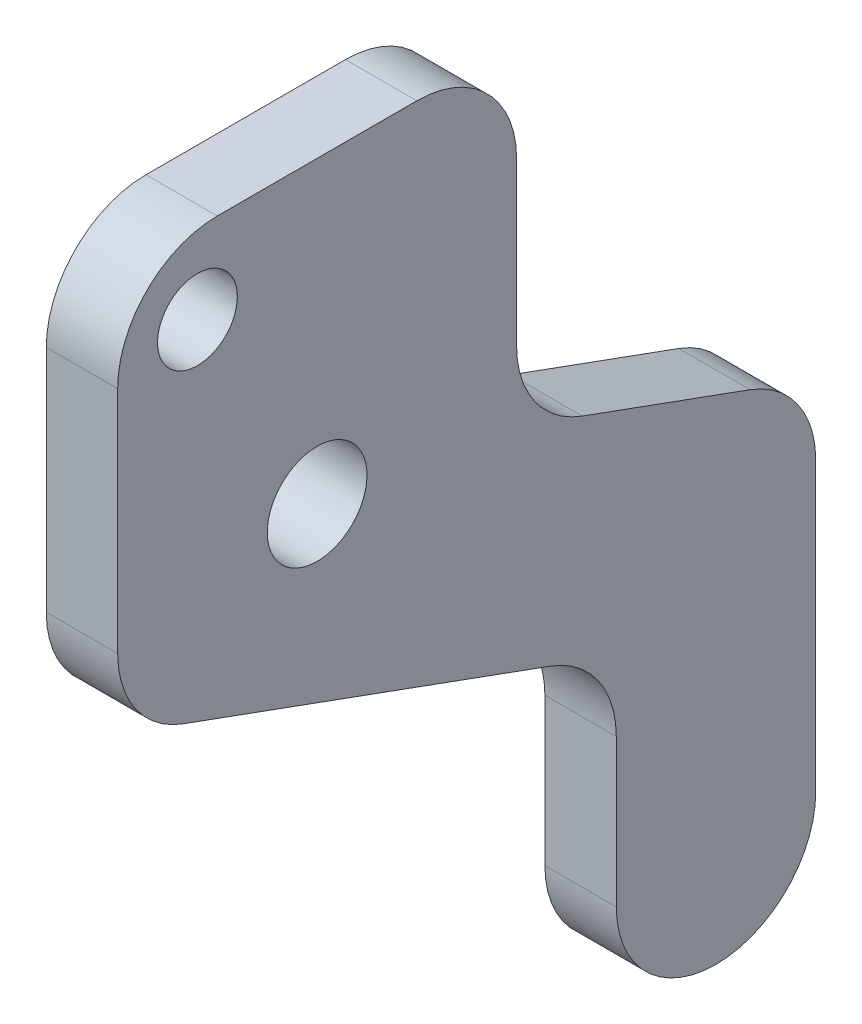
ISO-10303-21;
HEADER;
FILE_DESCRIPTION(('STEP AP214'),'2;1');
FILE_NAME('part.step','',(''),(''),'','','');
FILE_SCHEMA(('AUTOMOTIVE_DESIGN { 1 0 10303 214 1 1 1 1 }'));
ENDSEC;
DATA;
#1=APPLICATION_CONTEXT('core data for automotive mechanical design processes');
#2=APPLICATION_PROTOCOL_DEFINITION('international standard','automotive_design',2000,#1);
#3=PRODUCT_CONTEXT('',#1,'mechanical');
#4=PRODUCT('Part','Part','',(#3));
#5=PRODUCT_RELATED_PRODUCT_CATEGORY('part','',(#4));
#6=PRODUCT_DEFINITION_FORMATION('','',#4);
#7=PRODUCT_DEFINITION_CONTEXT('part definition',#1,'design');
#8=PRODUCT_DEFINITION('design','',#6,#7);
#9=PRODUCT_DEFINITION_SHAPE('','',#8);
#10=(LENGTH_UNIT() NAMED_UNIT(*) SI_UNIT(.MILLI.,.METRE.));
#11=(NAMED_UNIT(*) PLANE_ANGLE_UNIT() SI_UNIT($,.RADIAN.));
#12=(NAMED_UNIT(*) SI_UNIT($,.STERADIAN.) SOLID_ANGLE_UNIT());
#13=UNCERTAINTY_MEASURE_WITH_UNIT(LENGTH_MEASURE(1.E-05),#10,'distance_accuracy_value','');
#14=(GEOMETRIC_REPRESENTATION_CONTEXT(3) GLOBAL_UNCERTAINTY_ASSIGNED_CONTEXT((#13)) GLOBAL_UNIT_ASSIGNED_CONTEXT((#10,
#11,#12)) REPRESENTATION_CONTEXT('',''));
#15=CARTESIAN_POINT('',(0.,0.,0.));
#16=DIRECTION('',(0.,0.,1.));
#17=DIRECTION('',(1.,0.,0.));
#18=AXIS2_PLACEMENT_3D('',#15,#16,#17);
#19=CARTESIAN_POINT('',(230.378,0.,0.));
#20=DIRECTION('',(1.,0.,0.));
#21=DIRECTION('',(0.,0.,-1.));
#22=AXIS2_PLACEMENT_3D('',#19,#20,#21);
#23=PLANE('',#22);
#24=CARTESIAN_POINT('',(230.378,60.212881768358,-1160.75843540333));
#25=DIRECTION('',(1.,0.,0.));
#26=DIRECTION('',(0.,0.,-1.));
#27=AXIS2_PLACEMENT_3D('',#24,#25,#26);
#28=CIRCLE('',#27,2.54000000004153);
#29=CARTESIAN_POINT('',(230.378,60.212881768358,-1163.29843540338));
#30=VERTEX_POINT('',#29);
#31=EDGE_CURVE('E325',#30,#30,#28,.T.);
#32=ORIENTED_EDGE('',*,*,#31,.F.);
#33=EDGE_LOOP('',(#32));
#34=FACE_BOUND('',#33,.T.);
#35=DIRECTION('',(0.,1.,0.));
#36=VECTOR('',#35,1.);
#37=CARTESIAN_POINT('',(230.378,44.1630955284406,-1181.07843540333));
#38=LINE('',#37,#36);
#39=CARTESIAN_POINT('',(230.378,48.6094133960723,-1181.07843540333));
#40=VERTEX_POINT('',#39);
#41=CARTESIAN_POINT('',(230.378,58.942881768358,-1181.07843540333));
#42=VERTEX_POINT('',#41);
#43=EDGE_CURVE('E168',#40,#42,#38,.T.);
#44=ORIENTED_EDGE('',*,*,#43,.T.);
#45=CARTESIAN_POINT('',(230.378,58.942881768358,-1174.72843540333));
#46=DIRECTION('',(1.,0.,0.));
#47=DIRECTION('',(0.,0.,-1.));
#48=AXIS2_PLACEMENT_3D('',#45,#46,#47);
#49=CIRCLE('',#48,6.35);
#50=CARTESIAN_POINT('',(230.378,65.292881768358,-1174.72843540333));
#51=VERTEX_POINT('',#50);
#52=EDGE_CURVE('E225',#42,#51,#49,.T.);
#53=ORIENTED_EDGE('',*,*,#52,.T.);
#54=DIRECTION('',(0.,0.,1.));
#55=VECTOR('',#54,1.);
#56=CARTESIAN_POINT('',(230.378,65.292881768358,-1155.67843540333));
#57=LINE('',#56,#55);
#58=CARTESIAN_POINT('',(230.378,65.292881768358,-1162.02843540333));
#59=VERTEX_POINT('',#58);
#60=EDGE_CURVE('E176',#51,#59,#57,.T.);
#61=ORIENTED_EDGE('',*,*,#60,.T.);
#62=CARTESIAN_POINT('',(230.378,58.942881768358,-1162.02843540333));
#63=DIRECTION('',(1.,0.,0.));
#64=DIRECTION('',(0.,0.,-1.));
#65=AXIS2_PLACEMENT_3D('',#62,#63,#64);
#66=CIRCLE('',#65,6.35);
#67=CARTESIAN_POINT('',(230.378,58.942881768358,-1155.67843540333));
#68=VERTEX_POINT('',#67);
#69=EDGE_CURVE('E216',#59,#68,#66,.T.);
#70=ORIENTED_EDGE('',*,*,#69,.T.);
#71=DIRECTION('',(0.,-1.,0.));
#72=VECTOR('',#71,1.);
#73=CARTESIAN_POINT('',(230.378,65.292881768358,-1155.67843540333));
#74=LINE('',#73,#72);
#75=CARTESIAN_POINT('',(230.378,44.3391996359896,-1155.67843540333));
#76=VERTEX_POINT('',#75);
#77=EDGE_CURVE('E180',#68,#76,#74,.T.);
#78=ORIENTED_EDGE('',*,*,#77,.T.);
#79=CARTESIAN_POINT('',(230.378,44.3391996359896,-1162.02843540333));
#80=DIRECTION('',(1.,0.,0.));
#81=DIRECTION('',(0.,0.,-1.));
#82=AXIS2_PLACEMENT_3D('',#79,#80,#81);
#83=CIRCLE('',#82,6.35);
#84=CARTESIAN_POINT('',(230.378,38.3721514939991,-1159.85660749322));
#85=VERTEX_POINT('',#84);
#86=EDGE_CURVE('E218',#76,#85,#83,.T.);
#87=ORIENTED_EDGE('',*,*,#86,.T.);
#88=DIRECTION('',(0.,-0.342020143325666,-0.93969262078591));
#89=VECTOR('',#88,1.);
#90=CARTESIAN_POINT('',(230.378,39.892881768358,-1155.67843540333));
#91=LINE('',#90,#89);
#92=CARTESIAN_POINT('',(230.378,29.8575571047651,-1183.25026331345));
#93=VERTEX_POINT('',#92);
#94=EDGE_CURVE('E259',#85,#93,#91,.T.);
#95=ORIENTED_EDGE('',*,*,#94,.T.);
#96=CARTESIAN_POINT('',(230.378,23.8905089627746,-1181.07843540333));
#97=DIRECTION('',(1.,0.,0.));
#98=DIRECTION('',(0.,0.,-1.));
#99=AXIS2_PLACEMENT_3D('',#96,#97,#98);
#100=CIRCLE('',#99,6.35);
#101=CARTESIAN_POINT('',(230.378,23.8905089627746,-1187.42843540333));
#102=VERTEX_POINT('',#101);
#103=EDGE_CURVE('E11',#93,#102,#100,.F.);
#104=ORIENTED_EDGE('',*,*,#103,.T.);
#105=DIRECTION('',(0.,-1.,0.));
#106=VECTOR('',#105,1.);
#107=CARTESIAN_POINT('',(230.378,28.3368268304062,-1187.42843540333));
#108=LINE('',#107,#106);
#109=CARTESIAN_POINT('',(230.378,14.492881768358,-1187.42843540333));
#110=VERTEX_POINT('',#109);
#111=EDGE_CURVE('E257',#102,#110,#108,.T.);
#112=ORIENTED_EDGE('',*,*,#111,.T.);
#113=CARTESIAN_POINT('',(230.378,14.492881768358,-1193.77843540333));
#114=DIRECTION('',(1.,0.,0.));
#115=DIRECTION('',(0.,0.,-1.));
#116=AXIS2_PLACEMENT_3D('',#113,#114,#115);
#117=CIRCLE('',#116,6.35);
#118=CARTESIAN_POINT('',(230.378,8.14288176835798,-1193.77843540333));
#119=VERTEX_POINT('',#118);
#120=EDGE_CURVE('E220',#110,#119,#117,.T.);
#121=ORIENTED_EDGE('',*,*,#120,.T.);
#122=CARTESIAN_POINT('',(230.378,14.492881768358,-1193.77843540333));
#123=DIRECTION('',(1.,0.,0.));
#124=DIRECTION('',(0.,0.,-1.));
#125=AXIS2_PLACEMENT_3D('',#122,#123,#124);
#126=CIRCLE('',#125,6.35);
#127=CARTESIAN_POINT('',(230.378,14.492881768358,-1200.12843540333));
#128=VERTEX_POINT('',#127);
#129=EDGE_CURVE('E63',#119,#128,#126,.T.);
#130=ORIENTED_EDGE('',*,*,#129,.T.);
#131=DIRECTION('',(0.,1.,0.));
#132=VECTOR('',#131,1.);
#133=CARTESIAN_POINT('',(230.378,8.14288176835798,-1200.12843540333));
#134=LINE('',#133,#132);
#135=CARTESIAN_POINT('',(230.378,32.7831446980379,-1200.12843540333));
#136=VERTEX_POINT('',#135);
#137=EDGE_CURVE('E263',#128,#136,#134,.T.);
#138=ORIENTED_EDGE('',*,*,#137,.T.);
#139=CARTESIAN_POINT('',(230.378,32.7831446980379,-1193.77843540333));
#140=DIRECTION('',(1.,0.,0.));
#141=DIRECTION('',(0.,0.,-1.));
#142=AXIS2_PLACEMENT_3D('',#139,#140,#141);
#143=CIRCLE('',#142,6.35);
#144=CARTESIAN_POINT('',(230.378,38.7501928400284,-1195.95026331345));
#145=VERTEX_POINT('',#144);
#146=EDGE_CURVE('E223',#136,#145,#143,.T.);
#147=ORIENTED_EDGE('',*,*,#146,.T.);
#148=DIRECTION('',(0.,0.342020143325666,0.93969262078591));
#149=VECTOR('',#148,1.);
#150=CARTESIAN_POINT('',(230.378,37.2294625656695,-1200.12843540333));
#151=LINE('',#150,#149);
#152=CARTESIAN_POINT('',(230.378,42.6423652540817,-1185.25660749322));
#153=VERTEX_POINT('',#152);
#154=EDGE_CURVE('E265',#145,#153,#151,.T.);
#155=ORIENTED_EDGE('',*,*,#154,.T.);
#156=CARTESIAN_POINT('',(230.378,48.6094133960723,-1187.42843540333));
#157=DIRECTION('',(1.,0.,0.));
#158=DIRECTION('',(0.,0.,-1.));
#159=AXIS2_PLACEMENT_3D('',#156,#157,#158);
#160=CIRCLE('',#159,6.35);
#161=EDGE_CURVE('E158',#153,#40,#160,.F.);
#162=ORIENTED_EDGE('',*,*,#161,.T.);
#163=EDGE_LOOP('',(#44,#53,#61,#70,#78,#87,#95,#104,#112,#121,#130,#138,#147,#155,#162));
#164=FACE_BOUND('',#163,.T.);
#165=CARTESIAN_POINT('',(230.378,46.242881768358,-1168.37843540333));
#166=DIRECTION('',(1.,0.,0.));
#167=DIRECTION('',(0.,1.,0.));
#168=AXIS2_PLACEMENT_3D('',#165,#166,#167);
#169=CIRCLE('',#168,3.17500000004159);
#170=CARTESIAN_POINT('',(230.378,49.4178817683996,-1168.37843540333));
#171=VERTEX_POINT('',#170);
#172=EDGE_CURVE('E276',#171,#171,#169,.T.);
#173=ORIENTED_EDGE('',*,*,#172,.F.);
#174=EDGE_LOOP('',(#173));
#175=FACE_BOUND('',#174,.T.);
#176=ADVANCED_FACE('F40',(#34,#164,#175),#23,.T.);
#177=CARTESIAN_POINT('',(225.8314,0.,0.));
#178=DIRECTION('',(1.,0.,0.));
#179=DIRECTION('',(0.,0.,-1.));
#180=AXIS2_PLACEMENT_3D('',#177,#178,#179);
#181=PLANE('',#180);
#182=CARTESIAN_POINT('',(225.8314,60.212881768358,-1160.75843540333));
#183=DIRECTION('',(1.,0.,0.));
#184=DIRECTION('',(0.,0.,-1.));
#185=AXIS2_PLACEMENT_3D('',#182,#183,#184);
#186=CIRCLE('',#185,2.54000000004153);
#187=CARTESIAN_POINT('',(225.8314,60.212881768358,-1163.29843540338));
#188=VERTEX_POINT('',#187);
#189=EDGE_CURVE('E323',#188,#188,#186,.T.);
#190=ORIENTED_EDGE('',*,*,#189,.T.);
#191=EDGE_LOOP('',(#190));
#192=FACE_BOUND('',#191,.T.);
#193=DIRECTION('',(0.,0.,1.));
#194=VECTOR('',#193,1.);
#195=CARTESIAN_POINT('',(225.8314,65.292881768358,-1155.67843540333));
#196=LINE('',#195,#194);
#197=CARTESIAN_POINT('',(225.8314,65.292881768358,-1174.72843540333));
#198=VERTEX_POINT('',#197);
#199=CARTESIAN_POINT('',(225.8314,65.292881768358,-1162.02843540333));
#200=VERTEX_POINT('',#199);
#201=EDGE_CURVE('E273',#198,#200,#196,.T.);
#202=ORIENTED_EDGE('',*,*,#201,.F.);
#203=CARTESIAN_POINT('',(225.8314,58.942881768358,-1174.72843540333));
#204=DIRECTION('',(1.,0.,0.));
#205=DIRECTION('',(0.,0.,-1.));
#206=AXIS2_PLACEMENT_3D('',#203,#204,#205);
#207=CIRCLE('',#206,6.35);
#208=CARTESIAN_POINT('',(225.8314,58.942881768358,-1181.07843540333));
#209=VERTEX_POINT('',#208);
#210=EDGE_CURVE('E175',#198,#209,#207,.F.);
#211=ORIENTED_EDGE('',*,*,#210,.T.);
#212=DIRECTION('',(0.,1.,0.));
#213=VECTOR('',#212,1.);
#214=CARTESIAN_POINT('',(225.8314,44.1630955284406,-1181.07843540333));
#215=LINE('',#214,#213);
#216=CARTESIAN_POINT('',(225.8314,48.6094133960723,-1181.07843540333));
#217=VERTEX_POINT('',#216);
#218=EDGE_CURVE('E165',#217,#209,#215,.T.);
#219=ORIENTED_EDGE('',*,*,#218,.F.);
#220=CARTESIAN_POINT('',(225.8314,48.6094133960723,-1187.42843540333));
#221=DIRECTION('',(1.,0.,0.));
#222=DIRECTION('',(0.,0.,-1.));
#223=AXIS2_PLACEMENT_3D('',#220,#221,#222);
#224=CIRCLE('',#223,6.35);
#225=CARTESIAN_POINT('',(225.8314,42.6423652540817,-1185.25660749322));
#226=VERTEX_POINT('',#225);
#227=EDGE_CURVE('E148',#217,#226,#224,.T.);
#228=ORIENTED_EDGE('',*,*,#227,.T.);
#229=DIRECTION('',(0.,0.342020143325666,0.93969262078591));
#230=VECTOR('',#229,1.);
#231=CARTESIAN_POINT('',(225.8314,37.2294625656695,-1200.12843540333));
#232=LINE('',#231,#230);
#233=CARTESIAN_POINT('',(225.8314,38.7501928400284,-1195.95026331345));
#234=VERTEX_POINT('',#233);
#235=EDGE_CURVE('E177',#234,#226,#232,.T.);
#236=ORIENTED_EDGE('',*,*,#235,.F.);
#237=CARTESIAN_POINT('',(225.8314,32.7831446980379,-1193.77843540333));
#238=DIRECTION('',(1.,0.,0.));
#239=DIRECTION('',(0.,0.,-1.));
#240=AXIS2_PLACEMENT_3D('',#237,#238,#239);
#241=CIRCLE('',#240,6.35);
#242=CARTESIAN_POINT('',(225.8314,32.7831446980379,-1200.12843540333));
#243=VERTEX_POINT('',#242);
#244=EDGE_CURVE('E213',#234,#243,#241,.F.);
#245=ORIENTED_EDGE('',*,*,#244,.T.);
#246=DIRECTION('',(0.,1.,0.));
#247=VECTOR('',#246,1.);
#248=CARTESIAN_POINT('',(225.8314,8.14288176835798,-1200.12843540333));
#249=LINE('',#248,#247);
#250=CARTESIAN_POINT('',(225.8314,14.492881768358,-1200.12843540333));
#251=VERTEX_POINT('',#250);
#252=EDGE_CURVE('E182',#251,#243,#249,.T.);
#253=ORIENTED_EDGE('',*,*,#252,.F.);
#254=CARTESIAN_POINT('',(225.8314,14.492881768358,-1193.77843540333));
#255=DIRECTION('',(1.,0.,0.));
#256=DIRECTION('',(0.,0.,-1.));
#257=AXIS2_PLACEMENT_3D('',#254,#255,#256);
#258=CIRCLE('',#257,6.35);
#259=CARTESIAN_POINT('',(225.8314,8.14288176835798,-1193.77843540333));
#260=VERTEX_POINT('',#259);
#261=EDGE_CURVE('E211',#251,#260,#258,.F.);
#262=ORIENTED_EDGE('',*,*,#261,.T.);
#263=CARTESIAN_POINT('',(225.8314,14.492881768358,-1193.77843540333));
#264=DIRECTION('',(1.,0.,0.));
#265=DIRECTION('',(0.,0.,-1.));
#266=AXIS2_PLACEMENT_3D('',#263,#264,#265);
#267=CIRCLE('',#266,6.35);
#268=CARTESIAN_POINT('',(225.8314,14.492881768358,-1187.42843540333));
#269=VERTEX_POINT('',#268);
#270=EDGE_CURVE('E209',#260,#269,#267,.F.);
#271=ORIENTED_EDGE('',*,*,#270,.T.);
#272=DIRECTION('',(0.,-1.,0.));
#273=VECTOR('',#272,1.);
#274=CARTESIAN_POINT('',(225.8314,28.3368268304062,-1187.42843540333));
#275=LINE('',#274,#273);
#276=CARTESIAN_POINT('',(225.8314,23.8905089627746,-1187.42843540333));
#277=VERTEX_POINT('',#276);
#278=EDGE_CURVE('E241',#277,#269,#275,.T.);
#279=ORIENTED_EDGE('',*,*,#278,.F.);
#280=CARTESIAN_POINT('',(225.8314,23.8905089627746,-1181.07843540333));
#281=DIRECTION('',(1.,0.,0.));
#282=DIRECTION('',(0.,0.,-1.));
#283=AXIS2_PLACEMENT_3D('',#280,#281,#282);
#284=CIRCLE('',#283,6.35);
#285=CARTESIAN_POINT('',(225.8314,29.8575571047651,-1183.25026331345));
#286=VERTEX_POINT('',#285);
#287=EDGE_CURVE('E49',#277,#286,#284,.T.);
#288=ORIENTED_EDGE('',*,*,#287,.T.);
#289=DIRECTION('',(0.,-0.342020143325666,-0.93969262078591));
#290=VECTOR('',#289,1.);
#291=CARTESIAN_POINT('',(225.8314,39.892881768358,-1155.67843540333));
#292=LINE('',#291,#290);
#293=CARTESIAN_POINT('',(225.8314,38.3721514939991,-1159.85660749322));
#294=VERTEX_POINT('',#293);
#295=EDGE_CURVE('E239',#294,#286,#292,.T.);
#296=ORIENTED_EDGE('',*,*,#295,.F.);
#297=CARTESIAN_POINT('',(225.8314,44.3391996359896,-1162.02843540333));
#298=DIRECTION('',(1.,0.,0.));
#299=DIRECTION('',(0.,0.,-1.));
#300=AXIS2_PLACEMENT_3D('',#297,#298,#299);
#301=CIRCLE('',#300,6.35);
#302=CARTESIAN_POINT('',(225.8314,44.3391996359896,-1155.67843540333));
#303=VERTEX_POINT('',#302);
#304=EDGE_CURVE('E207',#294,#303,#301,.F.);
#305=ORIENTED_EDGE('',*,*,#304,.T.);
#306=DIRECTION('',(0.,-1.,0.));
#307=VECTOR('',#306,1.);
#308=CARTESIAN_POINT('',(225.8314,65.292881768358,-1155.67843540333));
#309=LINE('',#308,#307);
#310=CARTESIAN_POINT('',(225.8314,58.942881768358,-1155.67843540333));
#311=VERTEX_POINT('',#310);
#312=EDGE_CURVE('E250',#311,#303,#309,.T.);
#313=ORIENTED_EDGE('',*,*,#312,.F.);
#314=CARTESIAN_POINT('',(225.8314,58.942881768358,-1162.02843540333));
#315=DIRECTION('',(1.,0.,0.));
#316=DIRECTION('',(0.,0.,-1.));
#317=AXIS2_PLACEMENT_3D('',#314,#315,#316);
#318=CIRCLE('',#317,6.35);
#319=EDGE_CURVE('E205',#311,#200,#318,.F.);
#320=ORIENTED_EDGE('',*,*,#319,.T.);
#321=EDGE_LOOP('',(#202,#211,#219,#228,#236,#245,#253,#262,#271,#279,#288,#296,#305,#313,#320));
#322=FACE_BOUND('',#321,.T.);
#323=CARTESIAN_POINT('',(225.8314,46.242881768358,-1168.37843540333));
#324=DIRECTION('',(1.,0.,0.));
#325=DIRECTION('',(0.,1.,0.));
#326=AXIS2_PLACEMENT_3D('',#323,#324,#325);
#327=CIRCLE('',#326,3.17500000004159);
#328=CARTESIAN_POINT('',(225.8314,49.4178817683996,-1168.37843540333));
#329=VERTEX_POINT('',#328);
#330=EDGE_CURVE('E331',#329,#329,#327,.T.);
#331=ORIENTED_EDGE('',*,*,#330,.T.);
#332=EDGE_LOOP('',(#331));
#333=FACE_BOUND('',#332,.T.);
#334=ADVANCED_FACE('F173',(#192,#322,#333),#181,.F.);
#335=CARTESIAN_POINT('',(230.378,65.292881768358,-1155.67843540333));
#336=DIRECTION('',(0.,-1.,0.));
#337=DIRECTION('',(1.,0.,0.));
#338=AXIS2_PLACEMENT_3D('',#335,#336,#337);
#339=PLANE('',#338);
#340=ORIENTED_EDGE('',*,*,#60,.F.);
#341=DIRECTION('',(-1.,0.,0.));
#342=VECTOR('',#341,1.);
#343=CARTESIAN_POINT('',(230.378,65.292881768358,-1174.72843540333));
#344=LINE('',#343,#342);
#345=EDGE_CURVE('E202',#51,#198,#344,.T.);
#346=ORIENTED_EDGE('',*,*,#345,.T.);
#347=ORIENTED_EDGE('',*,*,#201,.T.);
#348=DIRECTION('',(-1.,0.,0.));
#349=VECTOR('',#348,1.);
#350=CARTESIAN_POINT('',(230.378,65.292881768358,-1162.02843540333));
#351=LINE('',#350,#349);
#352=EDGE_CURVE('E200',#200,#59,#351,.F.);
#353=ORIENTED_EDGE('',*,*,#352,.T.);
#354=EDGE_LOOP('',(#340,#346,#347,#353));
#355=FACE_BOUND('',#354,.T.);
#356=ADVANCED_FACE('F304',(#355),#339,.F.);
#357=CARTESIAN_POINT('',(230.378,65.292881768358,-1155.67843540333));
#358=DIRECTION('',(0.,0.,-1.));
#359=DIRECTION('',(-1.,0.,0.));
#360=AXIS2_PLACEMENT_3D('',#357,#358,#359);
#361=PLANE('',#360);
#362=ORIENTED_EDGE('',*,*,#312,.T.);
#363=DIRECTION('',(-1.,0.,0.));
#364=VECTOR('',#363,1.);
#365=CARTESIAN_POINT('',(230.378,44.3391996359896,-1155.67843540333));
#366=LINE('',#365,#364);
#367=EDGE_CURVE('E159',#303,#76,#366,.F.);
#368=ORIENTED_EDGE('',*,*,#367,.T.);
#369=ORIENTED_EDGE('',*,*,#77,.F.);
#370=DIRECTION('',(-1.,0.,0.));
#371=VECTOR('',#370,1.);
#372=CARTESIAN_POINT('',(230.378,58.942881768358,-1155.67843540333));
#373=LINE('',#372,#371);
#374=EDGE_CURVE('E231',#68,#311,#373,.T.);
#375=ORIENTED_EDGE('',*,*,#374,.T.);
#376=EDGE_LOOP('',(#362,#368,#369,#375));
#377=FACE_BOUND('',#376,.T.);
#378=ADVANCED_FACE('F342',(#377),#361,.F.);
#379=CARTESIAN_POINT('',(230.378,39.892881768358,-1155.67843540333));
#380=DIRECTION('',(0.,0.93969262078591,-0.342020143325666));
#381=DIRECTION('',(0.,0.342020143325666,0.93969262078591));
#382=AXIS2_PLACEMENT_3D('',#379,#380,#381);
#383=PLANE('',#382);
#384=ORIENTED_EDGE('',*,*,#295,.T.);
#385=DIRECTION('',(-1.,0.,0.));
#386=VECTOR('',#385,1.);
#387=CARTESIAN_POINT('',(230.378,29.8575571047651,-1183.25026331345));
#388=LINE('',#387,#386);
#389=EDGE_CURVE('E198',#286,#93,#388,.F.);
#390=ORIENTED_EDGE('',*,*,#389,.T.);
#391=ORIENTED_EDGE('',*,*,#94,.F.);
#392=DIRECTION('',(-1.,0.,0.));
#393=VECTOR('',#392,1.);
#394=CARTESIAN_POINT('',(230.378,38.3721514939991,-1159.85660749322));
#395=LINE('',#394,#393);
#396=EDGE_CURVE('E195',#85,#294,#395,.T.);
#397=ORIENTED_EDGE('',*,*,#396,.T.);
#398=EDGE_LOOP('',(#384,#390,#391,#397));
#399=FACE_BOUND('',#398,.T.);
#400=ADVANCED_FACE('F246',(#399),#383,.F.);
#401=CARTESIAN_POINT('',(230.378,28.3368268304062,-1187.42843540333));
#402=DIRECTION('',(0.,0.,-1.));
#403=DIRECTION('',(-1.,0.,0.));
#404=AXIS2_PLACEMENT_3D('',#401,#402,#403);
#405=PLANE('',#404);
#406=ORIENTED_EDGE('',*,*,#111,.F.);
#407=DIRECTION('',(-1.,0.,0.));
#408=VECTOR('',#407,1.);
#409=CARTESIAN_POINT('',(225.8314,23.8905089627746,-1187.42843540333));
#410=LINE('',#409,#408);
#411=EDGE_CURVE('E192',#102,#277,#410,.T.);
#412=ORIENTED_EDGE('',*,*,#411,.T.);
#413=ORIENTED_EDGE('',*,*,#278,.T.);
#414=DIRECTION('',(-1.,0.,0.));
#415=VECTOR('',#414,1.);
#416=CARTESIAN_POINT('',(230.378,14.492881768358,-1187.42843540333));
#417=LINE('',#416,#415);
#418=EDGE_CURVE('E190',#269,#110,#417,.F.);
#419=ORIENTED_EDGE('',*,*,#418,.T.);
#420=EDGE_LOOP('',(#406,#412,#413,#419));
#421=FACE_BOUND('',#420,.T.);
#422=ADVANCED_FACE('F261',(#421),#405,.F.);
#423=CARTESIAN_POINT('',(230.378,8.14288176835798,-1200.12843540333));
#424=DIRECTION('',(0.,0.,1.));
#425=DIRECTION('',(1.,0.,0.));
#426=AXIS2_PLACEMENT_3D('',#423,#424,#425);
#427=PLANE('',#426);
#428=ORIENTED_EDGE('',*,*,#252,.T.);
#429=DIRECTION('',(-1.,0.,0.));
#430=VECTOR('',#429,1.);
#431=CARTESIAN_POINT('',(230.378,32.7831446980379,-1200.12843540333));
#432=LINE('',#431,#430);
#433=EDGE_CURVE('E56',#243,#136,#432,.F.);
#434=ORIENTED_EDGE('',*,*,#433,.T.);
#435=ORIENTED_EDGE('',*,*,#137,.F.);
#436=DIRECTION('',(-1.,0.,0.));
#437=VECTOR('',#436,1.);
#438=CARTESIAN_POINT('',(230.378,14.492881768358,-1200.12843540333));
#439=LINE('',#438,#437);
#440=EDGE_CURVE('E227',#128,#251,#439,.T.);
#441=ORIENTED_EDGE('',*,*,#440,.T.);
#442=EDGE_LOOP('',(#428,#434,#435,#441));
#443=FACE_BOUND('',#442,.T.);
#444=ADVANCED_FACE('F280',(#443),#427,.F.);
#445=CARTESIAN_POINT('',(230.378,37.2294625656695,-1200.12843540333));
#446=DIRECTION('',(0.,-0.93969262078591,0.342020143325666));
#447=DIRECTION('',(0.,-0.342020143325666,-0.93969262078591));
#448=AXIS2_PLACEMENT_3D('',#445,#446,#447);
#449=PLANE('',#448);
#450=ORIENTED_EDGE('',*,*,#235,.T.);
#451=DIRECTION('',(-1.,0.,0.));
#452=VECTOR('',#451,1.);
#453=CARTESIAN_POINT('',(230.378,42.6423652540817,-1185.25660749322));
#454=LINE('',#453,#452);
#455=EDGE_CURVE('E153',#226,#153,#454,.F.);
#456=ORIENTED_EDGE('',*,*,#455,.T.);
#457=ORIENTED_EDGE('',*,*,#154,.F.);
#458=DIRECTION('',(-1.,0.,0.));
#459=VECTOR('',#458,1.);
#460=CARTESIAN_POINT('',(230.378,38.7501928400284,-1195.95026331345));
#461=LINE('',#460,#459);
#462=EDGE_CURVE('E169',#145,#234,#461,.T.);
#463=ORIENTED_EDGE('',*,*,#462,.T.);
#464=EDGE_LOOP('',(#450,#456,#457,#463));
#465=FACE_BOUND('',#464,.T.);
#466=ADVANCED_FACE('F288',(#465),#449,.F.);
#467=CARTESIAN_POINT('',(230.378,44.1630955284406,-1181.07843540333));
#468=DIRECTION('',(0.,0.,1.));
#469=DIRECTION('',(1.,0.,0.));
#470=AXIS2_PLACEMENT_3D('',#467,#468,#469);
#471=PLANE('',#470);
#472=ORIENTED_EDGE('',*,*,#43,.F.);
#473=DIRECTION('',(-1.,0.,0.));
#474=VECTOR('',#473,1.);
#475=CARTESIAN_POINT('',(225.8314,48.6094133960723,-1181.07843540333));
#476=LINE('',#475,#474);
#477=EDGE_CURVE('E152',#40,#217,#476,.T.);
#478=ORIENTED_EDGE('',*,*,#477,.T.);
#479=ORIENTED_EDGE('',*,*,#218,.T.);
#480=DIRECTION('',(-1.,0.,0.));
#481=VECTOR('',#480,1.);
#482=CARTESIAN_POINT('',(230.378,58.942881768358,-1181.07843540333));
#483=LINE('',#482,#481);
#484=EDGE_CURVE('E170',#209,#42,#483,.F.);
#485=ORIENTED_EDGE('',*,*,#484,.T.);
#486=EDGE_LOOP('',(#472,#478,#479,#485));
#487=FACE_BOUND('',#486,.T.);
#488=ADVANCED_FACE('F164',(#487),#471,.F.);
#489=CARTESIAN_POINT('',(230.378,46.242881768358,-1168.37843540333));
#490=DIRECTION('',(-1.,0.,0.));
#491=DIRECTION('',(0.,-1.,0.));
#492=AXIS2_PLACEMENT_3D('',#489,#490,#491);
#493=CYLINDRICAL_SURFACE('',#492,3.17500000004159);
#494=ORIENTED_EDGE('',*,*,#172,.T.);
#495=EDGE_LOOP('',(#494));
#496=FACE_BOUND('',#495,.T.);
#497=ORIENTED_EDGE('',*,*,#330,.F.);
#498=EDGE_LOOP('',(#497));
#499=FACE_BOUND('',#498,.T.);
#500=ADVANCED_FACE('F295',(#496,#499),#493,.F.);
#501=CARTESIAN_POINT('',(230.378,48.6094133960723,-1187.42843540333));
#502=DIRECTION('',(1.,0.,0.));
#503=DIRECTION('',(0.,1.,0.));
#504=AXIS2_PLACEMENT_3D('',#501,#502,#503);
#505=CYLINDRICAL_SURFACE('',#504,6.35);
#506=ORIENTED_EDGE('',*,*,#161,.F.);
#507=ORIENTED_EDGE('',*,*,#455,.F.);
#508=ORIENTED_EDGE('',*,*,#227,.F.);
#509=ORIENTED_EDGE('',*,*,#477,.F.);
#510=EDGE_LOOP('',(#506,#507,#508,#509));
#511=FACE_BOUND('',#510,.T.);
#512=ADVANCED_FACE('F151',(#511),#505,.F.);
#513=CARTESIAN_POINT('',(230.378,23.8905089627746,-1181.07843540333));
#514=DIRECTION('',(1.,0.,0.));
#515=DIRECTION('',(0.,1.,0.));
#516=AXIS2_PLACEMENT_3D('',#513,#514,#515);
#517=CYLINDRICAL_SURFACE('',#516,6.35);
#518=ORIENTED_EDGE('',*,*,#103,.F.);
#519=ORIENTED_EDGE('',*,*,#389,.F.);
#520=ORIENTED_EDGE('',*,*,#287,.F.);
#521=ORIENTED_EDGE('',*,*,#411,.F.);
#522=EDGE_LOOP('',(#518,#519,#520,#521));
#523=FACE_BOUND('',#522,.T.);
#524=ADVANCED_FACE('F253',(#523),#517,.F.);
#525=CARTESIAN_POINT('',(230.378,58.942881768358,-1174.72843540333));
#526=DIRECTION('',(-1.,0.,0.));
#527=DIRECTION('',(0.,-1.,0.));
#528=AXIS2_PLACEMENT_3D('',#525,#526,#527);
#529=CYLINDRICAL_SURFACE('',#528,6.35);
#530=ORIENTED_EDGE('',*,*,#52,.F.);
#531=ORIENTED_EDGE('',*,*,#484,.F.);
#532=ORIENTED_EDGE('',*,*,#210,.F.);
#533=ORIENTED_EDGE('',*,*,#345,.F.);
#534=EDGE_LOOP('',(#530,#531,#532,#533));
#535=FACE_BOUND('',#534,.T.);
#536=ADVANCED_FACE('F349',(#535),#529,.T.);
#537=CARTESIAN_POINT('',(230.378,32.7831446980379,-1193.77843540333));
#538=DIRECTION('',(-1.,0.,0.));
#539=DIRECTION('',(0.,-1.,0.));
#540=AXIS2_PLACEMENT_3D('',#537,#538,#539);
#541=CYLINDRICAL_SURFACE('',#540,6.35);
#542=ORIENTED_EDGE('',*,*,#146,.F.);
#543=ORIENTED_EDGE('',*,*,#433,.F.);
#544=ORIENTED_EDGE('',*,*,#244,.F.);
#545=ORIENTED_EDGE('',*,*,#462,.F.);
#546=EDGE_LOOP('',(#542,#543,#544,#545));
#547=FACE_BOUND('',#546,.T.);
#548=ADVANCED_FACE('F284',(#547),#541,.T.);
#549=CARTESIAN_POINT('',(230.378,14.492881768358,-1193.77843540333));
#550=DIRECTION('',(-1.,0.,0.));
#551=DIRECTION('',(0.,-1.,0.));
#552=AXIS2_PLACEMENT_3D('',#549,#550,#551);
#553=CYLINDRICAL_SURFACE('',#552,6.35);
#554=DIRECTION('',(-1.,0.,0.));
#555=VECTOR('',#554,1.);
#556=CARTESIAN_POINT('',(230.378,8.14288176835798,-1193.77843540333));
#557=LINE('',#556,#555);
#558=EDGE_CURVE('E44',#119,#260,#557,.T.);
#559=ORIENTED_EDGE('',*,*,#558,.F.);
#560=ORIENTED_EDGE('',*,*,#120,.F.);
#561=ORIENTED_EDGE('',*,*,#418,.F.);
#562=ORIENTED_EDGE('',*,*,#270,.F.);
#563=EDGE_LOOP('',(#559,#560,#561,#562));
#564=FACE_BOUND('',#563,.T.);
#565=ADVANCED_FACE('F356',(#564),#553,.T.);
#566=CARTESIAN_POINT('',(230.378,14.492881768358,-1193.77843540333));
#567=DIRECTION('',(-1.,0.,0.));
#568=DIRECTION('',(0.,-1.,0.));
#569=AXIS2_PLACEMENT_3D('',#566,#567,#568);
#570=CYLINDRICAL_SURFACE('',#569,6.35);
#571=ORIENTED_EDGE('',*,*,#129,.F.);
#572=ORIENTED_EDGE('',*,*,#558,.T.);
#573=ORIENTED_EDGE('',*,*,#261,.F.);
#574=ORIENTED_EDGE('',*,*,#440,.F.);
#575=EDGE_LOOP('',(#571,#572,#573,#574));
#576=FACE_BOUND('',#575,.T.);
#577=ADVANCED_FACE('F361',(#576),#570,.T.);
#578=CARTESIAN_POINT('',(230.378,44.3391996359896,-1162.02843540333));
#579=DIRECTION('',(-1.,0.,0.));
#580=DIRECTION('',(0.,-1.,0.));
#581=AXIS2_PLACEMENT_3D('',#578,#579,#580);
#582=CYLINDRICAL_SURFACE('',#581,6.35);
#583=ORIENTED_EDGE('',*,*,#86,.F.);
#584=ORIENTED_EDGE('',*,*,#367,.F.);
#585=ORIENTED_EDGE('',*,*,#304,.F.);
#586=ORIENTED_EDGE('',*,*,#396,.F.);
#587=EDGE_LOOP('',(#583,#584,#585,#586));
#588=FACE_BOUND('',#587,.T.);
#589=ADVANCED_FACE('F318',(#588),#582,.T.);
#590=CARTESIAN_POINT('',(230.378,58.942881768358,-1162.02843540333));
#591=DIRECTION('',(-1.,0.,0.));
#592=DIRECTION('',(0.,-1.,0.));
#593=AXIS2_PLACEMENT_3D('',#590,#591,#592);
#594=CYLINDRICAL_SURFACE('',#593,6.35);
#595=ORIENTED_EDGE('',*,*,#69,.F.);
#596=ORIENTED_EDGE('',*,*,#352,.F.);
#597=ORIENTED_EDGE('',*,*,#319,.F.);
#598=ORIENTED_EDGE('',*,*,#374,.F.);
#599=EDGE_LOOP('',(#595,#596,#597,#598));
#600=FACE_BOUND('',#599,.T.);
#601=ADVANCED_FACE('F42',(#600),#594,.T.);
#602=CARTESIAN_POINT('',(225.8314,60.212881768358,-1160.75843540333));
#603=DIRECTION('',(1.,0.,0.));
#604=DIRECTION('',(0.,0.,-1.));
#605=AXIS2_PLACEMENT_3D('',#602,#603,#604);
#606=CYLINDRICAL_SURFACE('',#605,2.54000000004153);
#607=ORIENTED_EDGE('',*,*,#189,.F.);
#608=EDGE_LOOP('',(#607));
#609=FACE_BOUND('',#608,.T.);
#610=ORIENTED_EDGE('',*,*,#31,.T.);
#611=EDGE_LOOP('',(#610));
#612=FACE_BOUND('',#611,.T.);
#613=ADVANCED_FACE('F312',(#609,#612),#606,.F.);
#614=CLOSED_SHELL('',(#176,#334,#356,#378,#400,#422,#444,#466,#488,#500,#512,#524,#536,#548,
#565,#577,#589,#601,#613));
#615=MANIFOLD_SOLID_BREP('B2',#614);
#616=ADVANCED_BREP_SHAPE_REPRESENTATION('',(#18,#615),#14);
#617=SHAPE_DEFINITION_REPRESENTATION(#9,#616);
ENDSEC;
END-ISO-10303-21;
